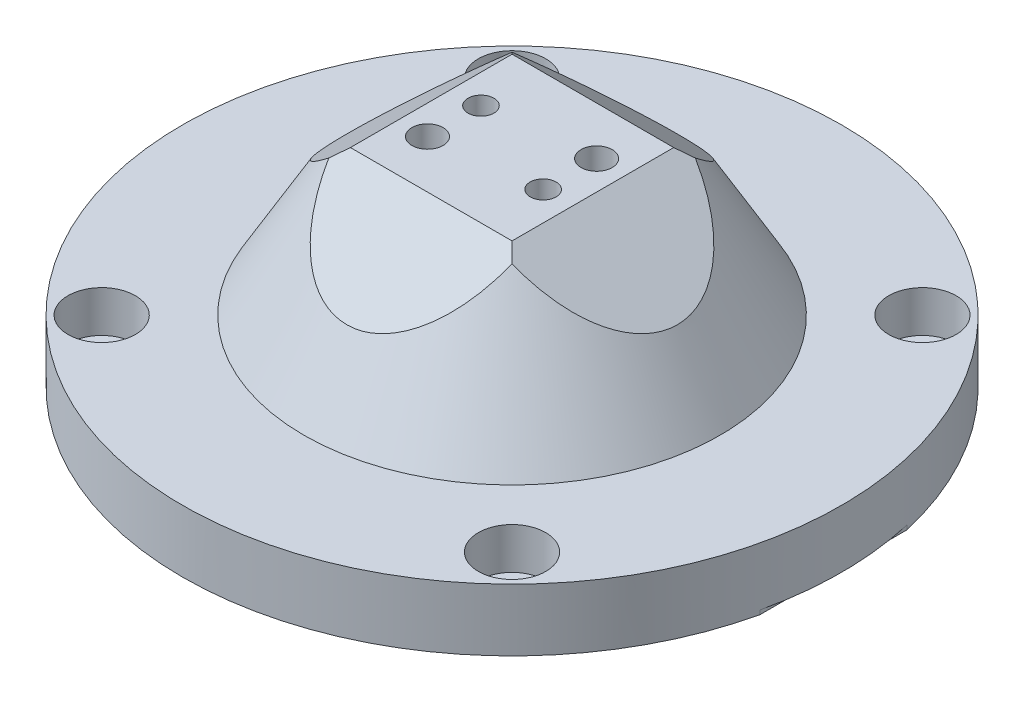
from build123d import *

# Parameters (mm, degrees)
SKETCH10_R                                       = 4.7752
CUT_EXTRUDE4_CENTER_BORE_DEPTH                   = 7.62
F_10_32_TAPPED_HOLE2_D                           = 4.0386
F_10_32_TAPPED_HOLE2_DEPTH                       = 12.0396
F_10_32_TAPPED_HOLE2_TIP                         = 1.213317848
CBORE_FOR_1_2_SOCKET_HEAD_CAP_SCREW1_D           = 13.49248
CBORE_FOR_1_2_SOCKET_HEAD_CAP_SCREW1_CBORE_D     = 20.6375
CBORE_FOR_1_2_SOCKET_HEAD_CAP_SCREW1_CBORE_DEPTH = 12.7
CIRPATTERN1_COUNT                                = 4
F_5_16_18_TAPPED_HOLE1_D                         = 6.5278
F_5_16_18_TAPPED_HOLE1_DEPTH                     = 24.5618
F_5_16_18_TAPPED_HOLE1_CBORE_D                   = 7.9375
F_5_16_18_TAPPED_HOLE1_CBORE_DEPTH               = 14.3256
F_5_16_18_TAPPED_HOLE1_TIP                       = 1.961148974
SKETCH7_R                                        = 4.7752
CUT_EXTRUDE2_FIXTURE_LOCATING_PIN_DEPTH          = 10.16
CUT_EXTRUDE3_DEPTH                               = 147.273459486
CIRPATTERN2_COUNT                                = 4
SKETCH13_R                                       = 3.1877
CUT_EXTRUDE5_CLOCKING_PIN_PIN_DEPTH              = 4.318
F_10_32_TAPPED_HOLE1_D                           = 4.0386
F_10_32_TAPPED_HOLE1_DEPTH                       = 12.0396
F_10_32_TAPPED_HOLE1_TIP                         = 1.213317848
CUT_EXTRUDE6_START                               = -1.27
CUT_EXTRUDE6_PRY_SLOTS_DEPTH                     = 1.27


with BuildPart() as part:
    # Sketch1 → Revolve1 (revolve)
    with BuildSketch(Plane.XY, mode=Mode.PRIVATE) as revolve1_sk:
        Polygon((0, -31.75), (-100.965, -31.75), (-100.965, -12.7), (-63.763219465, -12.7), (-38.1, 31.75), (0, 31.75), align=None)
    revolve(revolve1_sk.sketch.rotate(Axis((0, -31.75, 0), (0, 1, 0)), 270), axis=Axis((0, -31.75, 0), (0, 1, 0)))

    # Sketch10 → Cut-Extrude4 CENTER BORE (cut)
    with BuildSketch(Plane.XZ.offset(31.75)):
        with Locations(Location((0, 0, 0), (0, 0, 270))):
            Circle(SKETCH10_R)
    extrude(amount=-CUT_EXTRUDE4_CENTER_BORE_DEPTH, mode=Mode.SUBTRACT)

    # 10-32 Tapped Hole2
    with Locations(Plane.XZ.offset(24.13)):
        with Locations((0, 0)):
            Hole(F_10_32_TAPPED_HOLE2_D / 2, depth=F_10_32_TAPPED_HOLE2_DEPTH)
            with Locations((0, 0, -(F_10_32_TAPPED_HOLE2_DEPTH + F_10_32_TAPPED_HOLE2_TIP / 2))):  # 118° drill point
                Cone(0, F_10_32_TAPPED_HOLE2_D / 2, F_10_32_TAPPED_HOLE2_TIP, mode=Mode.SUBTRACT)

    # CBORE for 1_2 Socket Head Cap Screw1 (through all)
    with Locations(Plane(origin=(0, -12.7, 0), x_dir=(1, 0, 0), z_dir=(0, 1, 0))):
        with Locations((-62.861792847, 62.861792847)):
            cbore_for_1_2_socket_head_cap_screw1 = CounterBoreHole(CBORE_FOR_1_2_SOCKET_HEAD_CAP_SCREW1_D / 2, CBORE_FOR_1_2_SOCKET_HEAD_CAP_SCREW1_CBORE_D / 2, CBORE_FOR_1_2_SOCKET_HEAD_CAP_SCREW1_CBORE_DEPTH)

    # CirPattern1: CBORE for 1_2 Socket Head Cap Screw1 ×4 about axis
    cirpattern1_axis = Axis((0, 0, 0), (0, 1, 0))
    for i in range(1, CIRPATTERN1_COUNT):
        add(cbore_for_1_2_socket_head_cap_screw1.rotate(cirpattern1_axis, i * 360 / CIRPATTERN1_COUNT), mode=Mode.SUBTRACT)

    # 5_16-18 Tapped Hole1
    with Locations(Plane(origin=(0, 31.75, 0), x_dir=(-1, 0, 0), z_dir=(0, 1, 0))):
        with Locations((15.875, -6.35), (-15.875, 6.35)):
            CounterBoreHole(F_5_16_18_TAPPED_HOLE1_D / 2, F_5_16_18_TAPPED_HOLE1_CBORE_D / 2, F_5_16_18_TAPPED_HOLE1_CBORE_DEPTH, depth=F_5_16_18_TAPPED_HOLE1_DEPTH)
            with Locations((0, 0, -(F_5_16_18_TAPPED_HOLE1_DEPTH + F_5_16_18_TAPPED_HOLE1_TIP / 2))):  # 118° drill point
                Cone(0, F_5_16_18_TAPPED_HOLE1_D / 2, F_5_16_18_TAPPED_HOLE1_TIP, mode=Mode.SUBTRACT)

    # Sketch7 → Cut-Extrude2 FIXTURE LOCATING PIN (cut)
    with BuildSketch(Plane(origin=(0, 31.75, 0), x_dir=(1, 0, 0), z_dir=(0, 1, 0))):
        with Locations(Location((-15.875, -10.033, 0), (0, 0, 270))):
            Circle(SKETCH7_R)
        with Locations(Location((15.875, 10.033, 0), (0, 0, 270))):
            Circle(SKETCH7_R)
    extrude(amount=-CUT_EXTRUDE2_FIXTURE_LOCATING_PIN_DEPTH, mode=Mode.SUBTRACT)

    # Sketch9 → Cut-Extrude3 (cut, symmetric)
    with BuildSketch(Plane.XY):
        Polygon((-24.765, 31.75), (-50.630801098, 10.046015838), (-38.1, 31.75), align=None)
    cut_extrude3 = extrude(amount=CUT_EXTRUDE3_DEPTH, both=True, mode=Mode.SUBTRACT)

    # CirPattern2: Cut-Extrude3 ×4 about axis
    cirpattern2_axis = Axis((0, 0, 0), (0, 1, 0))
    for i in range(1, CIRPATTERN2_COUNT):
        add(cut_extrude3.rotate(cirpattern2_axis, i * 360 / CIRPATTERN2_COUNT), mode=Mode.SUBTRACT)

    # Sketch13 → Cut-Extrude5 CLOCKING PIN PIN (cut)
    with BuildSketch(Plane.XZ.offset(31.75)):
        with Locations(Location((-88.9, 0, 0), (0, 0, 270))):
            Circle(SKETCH13_R)
    extrude(amount=-CUT_EXTRUDE5_CLOCKING_PIN_PIN_DEPTH, mode=Mode.SUBTRACT)

    # 10-32 Tapped Hole1
    with Locations(Plane.XZ.offset(27.432)):
        with Locations((-88.9, 0)):
            Hole(F_10_32_TAPPED_HOLE1_D / 2, depth=F_10_32_TAPPED_HOLE1_DEPTH)
            with Locations((0, 0, -(F_10_32_TAPPED_HOLE1_DEPTH + F_10_32_TAPPED_HOLE1_TIP / 2))):  # 118° drill point
                Cone(0, F_10_32_TAPPED_HOLE1_D / 2, F_10_32_TAPPED_HOLE1_TIP, mode=Mode.SUBTRACT)

    # Sketch16 → Cut-Extrude6 PRY SLOTS (cut)
    with BuildSketch(Plane.XZ.offset(31.75).offset(CUT_EXTRUDE6_START)):
        with BuildLine():
            Line((-98.425, -22.504457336), (-98.425, 22.504457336))
            ThreePointArc((-98.425, 22.504457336), (-100.965, 0), (-98.425, -22.504457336))
        make_face()
        with BuildLine():
            Line((98.425, 22.504457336), (98.425, -22.504457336))
            ThreePointArc((98.425, -22.504457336), (100.965, 0), (98.425, 22.504457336))
        make_face()
    extrude(amount=CUT_EXTRUDE6_PRY_SLOTS_DEPTH, mode=Mode.SUBTRACT)


solid = part.part
